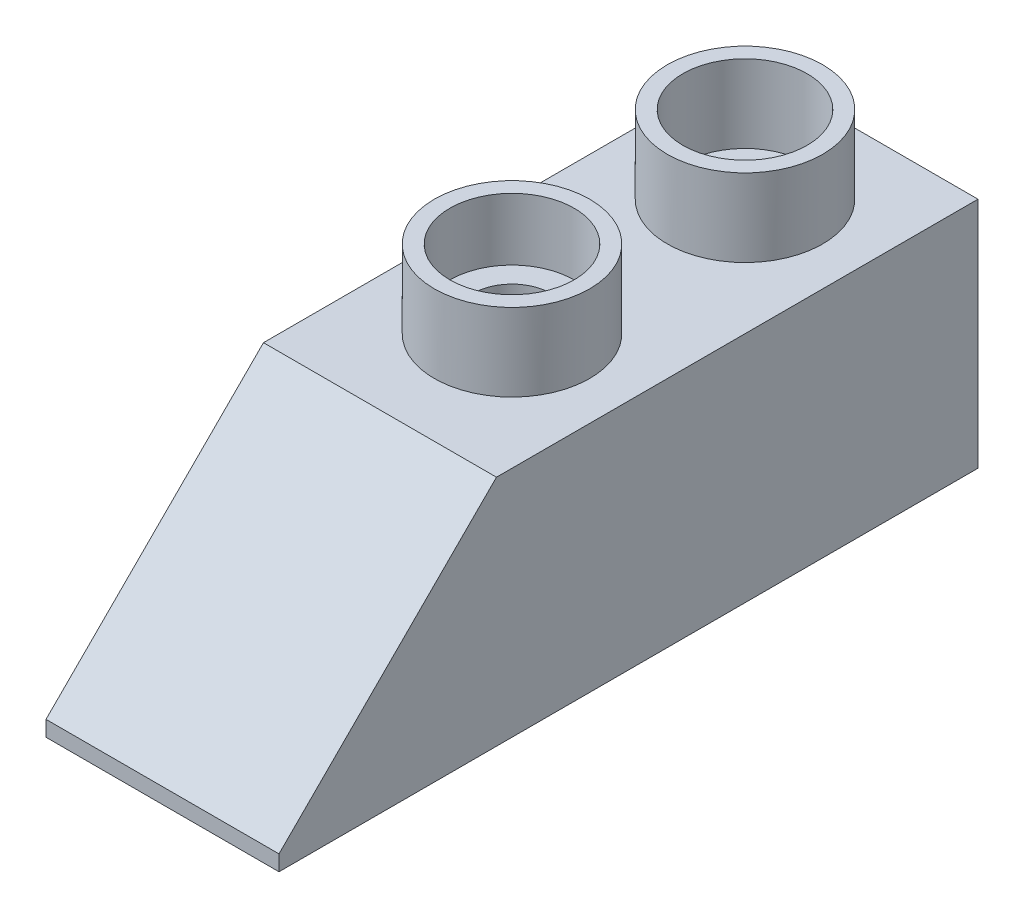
ISO-10303-21;
HEADER;
FILE_DESCRIPTION(('STEP AP214'),'2;1');
FILE_NAME('part.step','',(''),(''),'','','');
FILE_SCHEMA(('AUTOMOTIVE_DESIGN { 1 0 10303 214 1 1 1 1 }'));
ENDSEC;
DATA;
#1=APPLICATION_CONTEXT('core data for automotive mechanical design processes');
#2=APPLICATION_PROTOCOL_DEFINITION('international standard','automotive_design',2000,#1);
#3=PRODUCT_CONTEXT('',#1,'mechanical');
#4=PRODUCT('Part','Part','',(#3));
#5=PRODUCT_RELATED_PRODUCT_CATEGORY('part','',(#4));
#6=PRODUCT_DEFINITION_FORMATION('','',#4);
#7=PRODUCT_DEFINITION_CONTEXT('part definition',#1,'design');
#8=PRODUCT_DEFINITION('design','',#6,#7);
#9=PRODUCT_DEFINITION_SHAPE('','',#8);
#10=(LENGTH_UNIT() NAMED_UNIT(*) SI_UNIT(.MILLI.,.METRE.));
#11=(NAMED_UNIT(*) PLANE_ANGLE_UNIT() SI_UNIT($,.RADIAN.));
#12=(NAMED_UNIT(*) SI_UNIT($,.STERADIAN.) SOLID_ANGLE_UNIT());
#13=UNCERTAINTY_MEASURE_WITH_UNIT(LENGTH_MEASURE(1.E-05),#10,'distance_accuracy_value','');
#14=(GEOMETRIC_REPRESENTATION_CONTEXT(3) GLOBAL_UNCERTAINTY_ASSIGNED_CONTEXT((#13)) GLOBAL_UNIT_ASSIGNED_CONTEXT((#10,
#11,#12)) REPRESENTATION_CONTEXT('',''));
#15=CARTESIAN_POINT('',(0.,0.,0.));
#16=DIRECTION('',(0.,0.,1.));
#17=DIRECTION('',(1.,0.,0.));
#18=AXIS2_PLACEMENT_3D('',#15,#16,#17);
#19=CARTESIAN_POINT('',(0.,0.,0.));
#20=DIRECTION('',(0.,-1.,0.));
#21=DIRECTION('',(0.,0.,-1.));
#22=AXIS2_PLACEMENT_3D('',#19,#20,#21);
#23=PLANE('',#22);
#24=DIRECTION('',(0.,0.,-1.));
#25=VECTOR('',#24,1.);
#26=CARTESIAN_POINT('',(0.,0.,0.));
#27=LINE('',#26,#25);
#28=CARTESIAN_POINT('',(0.,0.,90.));
#29=VERTEX_POINT('',#28);
#30=CARTESIAN_POINT('',(0.,0.,0.));
#31=VERTEX_POINT('',#30);
#32=EDGE_CURVE('E217',#29,#31,#27,.T.);
#33=ORIENTED_EDGE('',*,*,#32,.F.);
#34=DIRECTION('',(1.,0.,0.));
#35=VECTOR('',#34,1.);
#36=CARTESIAN_POINT('',(0.,0.,90.));
#37=LINE('',#36,#35);
#38=CARTESIAN_POINT('',(-30.,0.,90.));
#39=VERTEX_POINT('',#38);
#40=EDGE_CURVE('E203',#39,#29,#37,.T.);
#41=ORIENTED_EDGE('',*,*,#40,.F.);
#42=DIRECTION('',(0.,0.,1.));
#43=VECTOR('',#42,1.);
#44=CARTESIAN_POINT('',(-30.,0.,0.));
#45=LINE('',#44,#43);
#46=CARTESIAN_POINT('',(-30.,0.,0.));
#47=VERTEX_POINT('',#46);
#48=EDGE_CURVE('E455',#47,#39,#45,.T.);
#49=ORIENTED_EDGE('',*,*,#48,.F.);
#50=DIRECTION('',(-1.,0.,0.));
#51=VECTOR('',#50,1.);
#52=CARTESIAN_POINT('',(0.,0.,0.));
#53=LINE('',#52,#51);
#54=EDGE_CURVE('E453',#31,#47,#53,.T.);
#55=ORIENTED_EDGE('',*,*,#54,.F.);
#56=EDGE_LOOP('',(#33,#41,#49,#55));
#57=FACE_BOUND('',#56,.T.);
#58=CARTESIAN_POINT('',(-26.5,0.,86.5));
#59=DIRECTION('',(0.,-1.,0.));
#60=DIRECTION('',(0.,0.,-1.));
#61=AXIS2_PLACEMENT_3D('',#58,#59,#60);
#62=CIRCLE('',#61,1.);
#63=CARTESIAN_POINT('',(-26.5,0.,87.5));
#64=VERTEX_POINT('',#63);
#65=CARTESIAN_POINT('',(-27.5,0.,86.5));
#66=VERTEX_POINT('',#65);
#67=EDGE_CURVE('E254',#64,#66,#62,.T.);
#68=ORIENTED_EDGE('',*,*,#67,.F.);
#69=DIRECTION('',(1.,0.,0.));
#70=VECTOR('',#69,1.);
#71=CARTESIAN_POINT('',(0.,0.,87.5));
#72=LINE('',#71,#70);
#73=CARTESIAN_POINT('',(-3.49999999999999,0.,87.5));
#74=VERTEX_POINT('',#73);
#75=EDGE_CURVE('E251',#64,#74,#72,.T.);
#76=ORIENTED_EDGE('',*,*,#75,.T.);
#77=CARTESIAN_POINT('',(-3.49999999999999,0.,86.5));
#78=DIRECTION('',(0.,-1.,0.));
#79=DIRECTION('',(0.,0.,-1.));
#80=AXIS2_PLACEMENT_3D('',#77,#78,#79);
#81=CIRCLE('',#80,1.);
#82=CARTESIAN_POINT('',(-2.49999999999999,0.,86.5));
#83=VERTEX_POINT('',#82);
#84=EDGE_CURVE('E248',#83,#74,#81,.T.);
#85=ORIENTED_EDGE('',*,*,#84,.F.);
#86=DIRECTION('',(0.,0.,-1.));
#87=VECTOR('',#86,1.);
#88=CARTESIAN_POINT('',(-2.5,0.,0.));
#89=LINE('',#88,#87);
#90=CARTESIAN_POINT('',(-2.5,0.,3.5));
#91=VERTEX_POINT('',#90);
#92=EDGE_CURVE('E246',#83,#91,#89,.T.);
#93=ORIENTED_EDGE('',*,*,#92,.T.);
#94=CARTESIAN_POINT('',(-3.5,0.,3.5));
#95=DIRECTION('',(0.,-1.,0.));
#96=DIRECTION('',(0.,0.,-1.));
#97=AXIS2_PLACEMENT_3D('',#94,#95,#96);
#98=CIRCLE('',#97,1.);
#99=CARTESIAN_POINT('',(-3.5,0.,2.5));
#100=VERTEX_POINT('',#99);
#101=EDGE_CURVE('E243',#100,#91,#98,.T.);
#102=ORIENTED_EDGE('',*,*,#101,.F.);
#103=DIRECTION('',(-1.,0.,0.));
#104=VECTOR('',#103,1.);
#105=CARTESIAN_POINT('',(0.,0.,2.5));
#106=LINE('',#105,#104);
#107=CARTESIAN_POINT('',(-26.5,0.,2.5));
#108=VERTEX_POINT('',#107);
#109=EDGE_CURVE('E239',#100,#108,#106,.T.);
#110=ORIENTED_EDGE('',*,*,#109,.T.);
#111=CARTESIAN_POINT('',(-26.5,0.,3.5));
#112=DIRECTION('',(0.,-1.,0.));
#113=DIRECTION('',(0.,0.,-1.));
#114=AXIS2_PLACEMENT_3D('',#111,#112,#113);
#115=CIRCLE('',#114,1.);
#116=CARTESIAN_POINT('',(-27.5,0.,3.5));
#117=VERTEX_POINT('',#116);
#118=EDGE_CURVE('E236',#117,#108,#115,.T.);
#119=ORIENTED_EDGE('',*,*,#118,.F.);
#120=DIRECTION('',(0.,0.,1.));
#121=VECTOR('',#120,1.);
#122=CARTESIAN_POINT('',(-27.5,0.,0.));
#123=LINE('',#122,#121);
#124=EDGE_CURVE('E241',#117,#66,#123,.T.);
#125=ORIENTED_EDGE('',*,*,#124,.T.);
#126=EDGE_LOOP('',(#68,#76,#85,#93,#102,#110,#119,#125));
#127=FACE_BOUND('',#126,.T.);
#128=ADVANCED_FACE('F44',(#57,#127),#23,.T.);
#129=CARTESIAN_POINT('',(-15.,0.,45.));
#130=DIRECTION('',(0.,-1.,0.));
#131=DIRECTION('',(0.,0.,-1.));
#132=AXIS2_PLACEMENT_3D('',#129,#130,#131);
#133=CIRCLE('',#132,7.5);
#134=CARTESIAN_POINT('',(-15.,0.,37.5));
#135=VERTEX_POINT('',#134);
#136=EDGE_CURVE('E294',#135,#135,#133,.T.);
#137=ORIENTED_EDGE('',*,*,#136,.T.);
#138=EDGE_LOOP('',(#137));
#139=FACE_BOUND('',#138,.T.);
#140=CARTESIAN_POINT('',(-15.,0.,45.));
#141=DIRECTION('',(0.,1.,0.));
#142=DIRECTION('',(0.,0.,1.));
#143=AXIS2_PLACEMENT_3D('',#140,#141,#142);
#144=CIRCLE('',#143,4.99999999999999);
#145=CARTESIAN_POINT('',(-15.,0.,50.));
#146=VERTEX_POINT('',#145);
#147=EDGE_CURVE('E429',#146,#146,#144,.T.);
#148=ORIENTED_EDGE('',*,*,#147,.T.);
#149=EDGE_LOOP('',(#148));
#150=FACE_BOUND('',#149,.T.);
#151=ADVANCED_FACE('F473',(#139,#150),#23,.T.);
#152=CARTESIAN_POINT('',(0.,30.,0.));
#153=DIRECTION('',(-1.,0.,0.));
#154=DIRECTION('',(0.,0.,1.));
#155=AXIS2_PLACEMENT_3D('',#152,#153,#154);
#156=PLANE('',#155);
#157=DIRECTION('',(0.,0.,-1.));
#158=VECTOR('',#157,1.);
#159=CARTESIAN_POINT('',(0.,30.,0.));
#160=LINE('',#159,#158);
#161=CARTESIAN_POINT('',(0.,30.,62.));
#162=VERTEX_POINT('',#161);
#163=CARTESIAN_POINT('',(0.,30.,0.));
#164=VERTEX_POINT('',#163);
#165=EDGE_CURVE('E193',#162,#164,#160,.T.);
#166=ORIENTED_EDGE('',*,*,#165,.F.);
#167=DIRECTION('',(0.,0.707106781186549,-0.707106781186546));
#168=VECTOR('',#167,1.);
#169=CARTESIAN_POINT('',(0.,30.,62.));
#170=LINE('',#169,#168);
#171=CARTESIAN_POINT('',(0.,1.99999999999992,90.));
#172=VERTEX_POINT('',#171);
#173=EDGE_CURVE('E230',#162,#172,#170,.F.);
#174=ORIENTED_EDGE('',*,*,#173,.T.);
#175=DIRECTION('',(0.,-1.,0.));
#176=VECTOR('',#175,1.);
#177=CARTESIAN_POINT('',(0.,30.,90.));
#178=LINE('',#177,#176);
#179=EDGE_CURVE('E451',#172,#29,#178,.T.);
#180=ORIENTED_EDGE('',*,*,#179,.T.);
#181=ORIENTED_EDGE('',*,*,#32,.T.);
#182=DIRECTION('',(0.,-1.,0.));
#183=VECTOR('',#182,1.);
#184=CARTESIAN_POINT('',(0.,30.,0.));
#185=LINE('',#184,#183);
#186=EDGE_CURVE('E208',#164,#31,#185,.T.);
#187=ORIENTED_EDGE('',*,*,#186,.F.);
#188=EDGE_LOOP('',(#166,#174,#180,#181,#187));
#189=FACE_BOUND('',#188,.T.);
#190=ADVANCED_FACE('F215',(#189),#156,.F.);
#191=CARTESIAN_POINT('',(0.,30.,0.));
#192=DIRECTION('',(0.,0.,1.));
#193=DIRECTION('',(1.,0.,0.));
#194=AXIS2_PLACEMENT_3D('',#191,#192,#193);
#195=PLANE('',#194);
#196=ORIENTED_EDGE('',*,*,#54,.T.);
#197=DIRECTION('',(0.,-1.,0.));
#198=VECTOR('',#197,1.);
#199=CARTESIAN_POINT('',(-30.,30.,0.));
#200=LINE('',#199,#198);
#201=CARTESIAN_POINT('',(-30.,30.,0.));
#202=VERTEX_POINT('',#201);
#203=EDGE_CURVE('E211',#202,#47,#200,.T.);
#204=ORIENTED_EDGE('',*,*,#203,.F.);
#205=DIRECTION('',(-1.,0.,0.));
#206=VECTOR('',#205,1.);
#207=CARTESIAN_POINT('',(0.,30.,0.));
#208=LINE('',#207,#206);
#209=EDGE_CURVE('E197',#164,#202,#208,.T.);
#210=ORIENTED_EDGE('',*,*,#209,.F.);
#211=ORIENTED_EDGE('',*,*,#186,.T.);
#212=EDGE_LOOP('',(#196,#204,#210,#211));
#213=FACE_BOUND('',#212,.T.);
#214=ADVANCED_FACE('F207',(#213),#195,.F.);
#215=CARTESIAN_POINT('',(-30.,30.,0.));
#216=DIRECTION('',(1.,0.,0.));
#217=DIRECTION('',(0.,0.,-1.));
#218=AXIS2_PLACEMENT_3D('',#215,#216,#217);
#219=PLANE('',#218);
#220=DIRECTION('',(0.,-1.,0.));
#221=VECTOR('',#220,1.);
#222=CARTESIAN_POINT('',(-30.,30.,90.));
#223=LINE('',#222,#221);
#224=CARTESIAN_POINT('',(-30.,1.99999999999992,90.));
#225=VERTEX_POINT('',#224);
#226=EDGE_CURVE('E223',#225,#39,#223,.T.);
#227=ORIENTED_EDGE('',*,*,#226,.F.);
#228=DIRECTION('',(0.,-0.707106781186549,0.707106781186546));
#229=VECTOR('',#228,1.);
#230=CARTESIAN_POINT('',(-30.,30.,62.));
#231=LINE('',#230,#229);
#232=CARTESIAN_POINT('',(-30.,30.,62.));
#233=VERTEX_POINT('',#232);
#234=EDGE_CURVE('E234',#225,#233,#231,.F.);
#235=ORIENTED_EDGE('',*,*,#234,.T.);
#236=DIRECTION('',(0.,0.,1.));
#237=VECTOR('',#236,1.);
#238=CARTESIAN_POINT('',(-30.,30.,0.));
#239=LINE('',#238,#237);
#240=EDGE_CURVE('E213',#202,#233,#239,.T.);
#241=ORIENTED_EDGE('',*,*,#240,.F.);
#242=ORIENTED_EDGE('',*,*,#203,.T.);
#243=ORIENTED_EDGE('',*,*,#48,.T.);
#244=EDGE_LOOP('',(#227,#235,#241,#242,#243));
#245=FACE_BOUND('',#244,.T.);
#246=ADVANCED_FACE('F469',(#245),#219,.F.);
#247=CARTESIAN_POINT('',(0.,30.,90.));
#248=DIRECTION('',(0.,0.,-1.));
#249=DIRECTION('',(-1.,0.,0.));
#250=AXIS2_PLACEMENT_3D('',#247,#248,#249);
#251=PLANE('',#250);
#252=ORIENTED_EDGE('',*,*,#179,.F.);
#253=DIRECTION('',(-1.,0.,0.));
#254=VECTOR('',#253,1.);
#255=CARTESIAN_POINT('',(0.,1.99999999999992,90.));
#256=LINE('',#255,#254);
#257=EDGE_CURVE('E232',#172,#225,#256,.T.);
#258=ORIENTED_EDGE('',*,*,#257,.T.);
#259=ORIENTED_EDGE('',*,*,#226,.T.);
#260=ORIENTED_EDGE('',*,*,#40,.T.);
#261=EDGE_LOOP('',(#252,#258,#259,#260));
#262=FACE_BOUND('',#261,.T.);
#263=ADVANCED_FACE('F463',(#262),#251,.F.);
#264=CARTESIAN_POINT('',(0.,30.,0.));
#265=DIRECTION('',(0.,-1.,0.));
#266=DIRECTION('',(0.,0.,-1.));
#267=AXIS2_PLACEMENT_3D('',#264,#265,#266);
#268=PLANE('',#267);
#269=CARTESIAN_POINT('',(-15.,30.,45.));
#270=DIRECTION('',(0.,-1.,0.));
#271=DIRECTION('',(0.,0.,-1.));
#272=AXIS2_PLACEMENT_3D('',#269,#270,#271);
#273=CIRCLE('',#272,10.);
#274=CARTESIAN_POINT('',(-15.,30.,35.));
#275=VERTEX_POINT('',#274);
#276=EDGE_CURVE('E221',#275,#275,#273,.F.);
#277=ORIENTED_EDGE('',*,*,#276,.F.);
#278=EDGE_LOOP('',(#277));
#279=FACE_BOUND('',#278,.T.);
#280=CARTESIAN_POINT('',(-15.,30.,15.));
#281=DIRECTION('',(0.,-1.,0.));
#282=DIRECTION('',(0.,0.,-1.));
#283=AXIS2_PLACEMENT_3D('',#280,#281,#282);
#284=CIRCLE('',#283,10.);
#285=CARTESIAN_POINT('',(-15.,30.,5.));
#286=VERTEX_POINT('',#285);
#287=EDGE_CURVE('E218',#286,#286,#284,.F.);
#288=ORIENTED_EDGE('',*,*,#287,.F.);
#289=EDGE_LOOP('',(#288));
#290=FACE_BOUND('',#289,.T.);
#291=ORIENTED_EDGE('',*,*,#240,.T.);
#292=DIRECTION('',(1.,0.,0.));
#293=VECTOR('',#292,1.);
#294=CARTESIAN_POINT('',(0.,30.,62.));
#295=LINE('',#294,#293);
#296=EDGE_CURVE('E200',#233,#162,#295,.T.);
#297=ORIENTED_EDGE('',*,*,#296,.T.);
#298=ORIENTED_EDGE('',*,*,#165,.T.);
#299=ORIENTED_EDGE('',*,*,#209,.T.);
#300=EDGE_LOOP('',(#291,#297,#298,#299));
#301=FACE_BOUND('',#300,.T.);
#302=ADVANCED_FACE('F196',(#279,#290,#301),#268,.F.);
#303=CARTESIAN_POINT('',(-15.,0.,15.));
#304=DIRECTION('',(0.,-1.,0.));
#305=DIRECTION('',(0.,0.,-1.));
#306=AXIS2_PLACEMENT_3D('',#303,#304,#305);
#307=CIRCLE('',#306,7.5);
#308=CARTESIAN_POINT('',(-15.,0.,7.5));
#309=VERTEX_POINT('',#308);
#310=EDGE_CURVE('E303',#309,#309,#307,.T.);
#311=ORIENTED_EDGE('',*,*,#310,.T.);
#312=EDGE_LOOP('',(#311));
#313=FACE_BOUND('',#312,.T.);
#314=CARTESIAN_POINT('',(-15.,0.,15.));
#315=DIRECTION('',(0.,1.,0.));
#316=DIRECTION('',(0.,0.,1.));
#317=AXIS2_PLACEMENT_3D('',#314,#315,#316);
#318=CIRCLE('',#317,5.);
#319=CARTESIAN_POINT('',(-15.,0.,20.));
#320=VERTEX_POINT('',#319);
#321=EDGE_CURVE('E433',#320,#320,#318,.T.);
#322=ORIENTED_EDGE('',*,*,#321,.T.);
#323=EDGE_LOOP('',(#322));
#324=FACE_BOUND('',#323,.T.);
#325=ADVANCED_FACE('F475',(#313,#324),#23,.T.);
#326=CARTESIAN_POINT('',(-15.,40.,15.));
#327=DIRECTION('',(0.,-1.,0.));
#328=DIRECTION('',(0.,0.,-1.));
#329=AXIS2_PLACEMENT_3D('',#326,#327,#328);
#330=CYLINDRICAL_SURFACE('',#329,10.);
#331=CARTESIAN_POINT('',(-15.,40.,15.));
#332=DIRECTION('',(0.,1.,0.));
#333=DIRECTION('',(0.,0.,1.));
#334=AXIS2_PLACEMENT_3D('',#331,#332,#333);
#335=CIRCLE('',#334,10.);
#336=CARTESIAN_POINT('',(-15.,40.,25.));
#337=VERTEX_POINT('',#336);
#338=EDGE_CURVE('E447',#337,#337,#335,.T.);
#339=ORIENTED_EDGE('',*,*,#338,.F.);
#340=EDGE_LOOP('',(#339));
#341=FACE_BOUND('',#340,.T.);
#342=ORIENTED_EDGE('',*,*,#287,.T.);
#343=EDGE_LOOP('',(#342));
#344=FACE_BOUND('',#343,.T.);
#345=ADVANCED_FACE('F671',(#341,#344),#330,.T.);
#346=CARTESIAN_POINT('',(-15.,40.,15.));
#347=DIRECTION('',(0.,1.,0.));
#348=DIRECTION('',(0.,0.,1.));
#349=AXIS2_PLACEMENT_3D('',#346,#347,#348);
#350=PLANE('',#349);
#351=CARTESIAN_POINT('',(-15.,40.,15.));
#352=DIRECTION('',(0.,1.,0.));
#353=DIRECTION('',(0.,0.,1.));
#354=AXIS2_PLACEMENT_3D('',#351,#352,#353);
#355=CIRCLE('',#354,8.);
#356=CARTESIAN_POINT('',(-15.,40.,23.));
#357=VERTEX_POINT('',#356);
#358=EDGE_CURVE('E436',#357,#357,#355,.T.);
#359=ORIENTED_EDGE('',*,*,#358,.F.);
#360=EDGE_LOOP('',(#359));
#361=FACE_BOUND('',#360,.T.);
#362=ORIENTED_EDGE('',*,*,#338,.T.);
#363=EDGE_LOOP('',(#362));
#364=FACE_BOUND('',#363,.T.);
#365=ADVANCED_FACE('F667',(#361,#364),#350,.T.);
#366=CARTESIAN_POINT('',(-15.,40.,45.));
#367=DIRECTION('',(0.,-1.,0.));
#368=DIRECTION('',(0.,0.,-1.));
#369=AXIS2_PLACEMENT_3D('',#366,#367,#368);
#370=CYLINDRICAL_SURFACE('',#369,10.);
#371=CARTESIAN_POINT('',(-15.,40.,45.));
#372=DIRECTION('',(0.,1.,0.));
#373=DIRECTION('',(0.,0.,1.));
#374=AXIS2_PLACEMENT_3D('',#371,#372,#373);
#375=CIRCLE('',#374,10.);
#376=CARTESIAN_POINT('',(-15.,40.,55.));
#377=VERTEX_POINT('',#376);
#378=EDGE_CURVE('E442',#377,#377,#375,.T.);
#379=ORIENTED_EDGE('',*,*,#378,.F.);
#380=EDGE_LOOP('',(#379));
#381=FACE_BOUND('',#380,.T.);
#382=ORIENTED_EDGE('',*,*,#276,.T.);
#383=EDGE_LOOP('',(#382));
#384=FACE_BOUND('',#383,.T.);
#385=ADVANCED_FACE('F663',(#381,#384),#370,.T.);
#386=CARTESIAN_POINT('',(-15.,40.,45.));
#387=DIRECTION('',(0.,1.,0.));
#388=DIRECTION('',(0.,0.,1.));
#389=AXIS2_PLACEMENT_3D('',#386,#387,#388);
#390=PLANE('',#389);
#391=CARTESIAN_POINT('',(-15.,40.,45.));
#392=DIRECTION('',(0.,1.,0.));
#393=DIRECTION('',(0.,0.,1.));
#394=AXIS2_PLACEMENT_3D('',#391,#392,#393);
#395=CIRCLE('',#394,8.);
#396=CARTESIAN_POINT('',(-15.,40.,53.));
#397=VERTEX_POINT('',#396);
#398=EDGE_CURVE('E416',#397,#397,#395,.T.);
#399=ORIENTED_EDGE('',*,*,#398,.F.);
#400=EDGE_LOOP('',(#399));
#401=FACE_BOUND('',#400,.T.);
#402=ORIENTED_EDGE('',*,*,#378,.T.);
#403=EDGE_LOOP('',(#402));
#404=FACE_BOUND('',#403,.T.);
#405=ADVANCED_FACE('F659',(#401,#404),#390,.T.);
#406=CARTESIAN_POINT('',(-15.,30.,15.));
#407=DIRECTION('',(0.,1.,0.));
#408=DIRECTION('',(0.,0.,1.));
#409=AXIS2_PLACEMENT_3D('',#406,#407,#408);
#410=CYLINDRICAL_SURFACE('',#409,8.);
#411=CARTESIAN_POINT('',(-15.,30.,15.));
#412=DIRECTION('',(0.,1.,0.));
#413=DIRECTION('',(0.,0.,1.));
#414=AXIS2_PLACEMENT_3D('',#411,#412,#413);
#415=CIRCLE('',#414,8.);
#416=CARTESIAN_POINT('',(-15.,30.,23.));
#417=VERTEX_POINT('',#416);
#418=EDGE_CURVE('E439',#417,#417,#415,.T.);
#419=ORIENTED_EDGE('',*,*,#418,.F.);
#420=EDGE_LOOP('',(#419));
#421=FACE_BOUND('',#420,.T.);
#422=ORIENTED_EDGE('',*,*,#358,.T.);
#423=EDGE_LOOP('',(#422));
#424=FACE_BOUND('',#423,.T.);
#425=ADVANCED_FACE('F655',(#421,#424),#410,.F.);
#426=CARTESIAN_POINT('',(-15.,30.,15.));
#427=DIRECTION('',(0.,1.,0.));
#428=DIRECTION('',(0.,0.,1.));
#429=AXIS2_PLACEMENT_3D('',#426,#427,#428);
#430=PLANE('',#429);
#431=CARTESIAN_POINT('',(-15.,30.,15.));
#432=DIRECTION('',(0.,1.,0.));
#433=DIRECTION('',(0.,0.,1.));
#434=AXIS2_PLACEMENT_3D('',#431,#432,#433);
#435=CIRCLE('',#434,5.);
#436=CARTESIAN_POINT('',(-15.,30.,20.));
#437=VERTEX_POINT('',#436);
#438=EDGE_CURVE('E432',#437,#437,#435,.T.);
#439=ORIENTED_EDGE('',*,*,#438,.F.);
#440=EDGE_LOOP('',(#439));
#441=FACE_BOUND('',#440,.T.);
#442=ORIENTED_EDGE('',*,*,#418,.T.);
#443=EDGE_LOOP('',(#442));
#444=FACE_BOUND('',#443,.T.);
#445=ADVANCED_FACE('F651',(#441,#444),#430,.T.);
#446=CARTESIAN_POINT('',(-15.,0.,15.));
#447=DIRECTION('',(0.,1.,0.));
#448=DIRECTION('',(0.,0.,1.));
#449=AXIS2_PLACEMENT_3D('',#446,#447,#448);
#450=CYLINDRICAL_SURFACE('',#449,5.);
#451=ORIENTED_EDGE('',*,*,#321,.F.);
#452=EDGE_LOOP('',(#451));
#453=FACE_BOUND('',#452,.T.);
#454=ORIENTED_EDGE('',*,*,#438,.T.);
#455=EDGE_LOOP('',(#454));
#456=FACE_BOUND('',#455,.T.);
#457=ADVANCED_FACE('F647',(#453,#456),#450,.F.);
#458=CARTESIAN_POINT('',(-15.,40.,45.));
#459=DIRECTION('',(0.,1.,0.));
#460=DIRECTION('',(0.,0.,1.));
#461=AXIS2_PLACEMENT_3D('',#458,#459,#460);
#462=CYLINDRICAL_SURFACE('',#461,5.);
#463=ORIENTED_EDGE('',*,*,#147,.F.);
#464=EDGE_LOOP('',(#463));
#465=FACE_BOUND('',#464,.T.);
#466=CARTESIAN_POINT('',(-15.,32.,45.));
#467=DIRECTION('',(0.,1.,0.));
#468=DIRECTION('',(0.,0.,1.));
#469=AXIS2_PLACEMENT_3D('',#466,#467,#468);
#470=CIRCLE('',#469,5.);
#471=CARTESIAN_POINT('',(-15.,32.,50.));
#472=VERTEX_POINT('',#471);
#473=EDGE_CURVE('E424',#472,#472,#470,.T.);
#474=ORIENTED_EDGE('',*,*,#473,.T.);
#475=EDGE_LOOP('',(#474));
#476=FACE_BOUND('',#475,.T.);
#477=ADVANCED_FACE('F643',(#465,#476),#462,.F.);
#478=CARTESIAN_POINT('',(-10.,32.,45.));
#479=DIRECTION('',(0.,-1.,0.));
#480=DIRECTION('',(0.,0.,-1.));
#481=AXIS2_PLACEMENT_3D('',#478,#479,#480);
#482=PLANE('',#481);
#483=ORIENTED_EDGE('',*,*,#473,.F.);
#484=EDGE_LOOP('',(#483));
#485=FACE_BOUND('',#484,.T.);
#486=CARTESIAN_POINT('',(-15.,32.,45.));
#487=DIRECTION('',(0.,1.,0.));
#488=DIRECTION('',(0.,0.,1.));
#489=AXIS2_PLACEMENT_3D('',#486,#487,#488);
#490=CIRCLE('',#489,8.);
#491=CARTESIAN_POINT('',(-15.,32.,53.));
#492=VERTEX_POINT('',#491);
#493=EDGE_CURVE('E419',#492,#492,#490,.T.);
#494=ORIENTED_EDGE('',*,*,#493,.T.);
#495=EDGE_LOOP('',(#494));
#496=FACE_BOUND('',#495,.T.);
#497=ADVANCED_FACE('F639',(#485,#496),#482,.F.);
#498=CARTESIAN_POINT('',(-15.,40.,45.));
#499=DIRECTION('',(0.,1.,0.));
#500=DIRECTION('',(0.,0.,1.));
#501=AXIS2_PLACEMENT_3D('',#498,#499,#500);
#502=CYLINDRICAL_SURFACE('',#501,8.);
#503=ORIENTED_EDGE('',*,*,#493,.F.);
#504=EDGE_LOOP('',(#503));
#505=FACE_BOUND('',#504,.T.);
#506=ORIENTED_EDGE('',*,*,#398,.T.);
#507=EDGE_LOOP('',(#506));
#508=FACE_BOUND('',#507,.T.);
#509=ADVANCED_FACE('F635',(#505,#508),#502,.F.);
#510=CARTESIAN_POINT('',(0.,30.,62.));
#511=DIRECTION('',(0.,-0.707106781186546,-0.707106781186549));
#512=DIRECTION('',(1.,0.,0.));
#513=AXIS2_PLACEMENT_3D('',#510,#511,#512);
#514=PLANE('',#513);
#515=ORIENTED_EDGE('',*,*,#234,.F.);
#516=ORIENTED_EDGE('',*,*,#257,.F.);
#517=ORIENTED_EDGE('',*,*,#173,.F.);
#518=ORIENTED_EDGE('',*,*,#296,.F.);
#519=EDGE_LOOP('',(#515,#516,#517,#518));
#520=FACE_BOUND('',#519,.T.);
#521=ADVANCED_FACE('F638',(#520),#514,.F.);
#522=CARTESIAN_POINT('',(0.,27.,0.));
#523=DIRECTION('',(0.,-1.,0.));
#524=DIRECTION('',(0.,0.,-1.));
#525=AXIS2_PLACEMENT_3D('',#522,#523,#524);
#526=PLANE('',#525);
#527=CARTESIAN_POINT('',(-15.,27.,45.));
#528=DIRECTION('',(0.,-1.,0.));
#529=DIRECTION('',(0.,0.,-1.));
#530=AXIS2_PLACEMENT_3D('',#527,#528,#529);
#531=CIRCLE('',#530,8.5);
#532=CARTESIAN_POINT('',(-15.,27.,36.5));
#533=VERTEX_POINT('',#532);
#534=EDGE_CURVE('E327',#533,#533,#531,.F.);
#535=ORIENTED_EDGE('',*,*,#534,.T.);
#536=EDGE_LOOP('',(#535));
#537=FACE_BOUND('',#536,.T.);
#538=CARTESIAN_POINT('',(-15.,27.,15.));
#539=DIRECTION('',(0.,-1.,0.));
#540=DIRECTION('',(0.,0.,-1.));
#541=AXIS2_PLACEMENT_3D('',#538,#539,#540);
#542=CIRCLE('',#541,8.5);
#543=CARTESIAN_POINT('',(-15.,27.,6.5));
#544=VERTEX_POINT('',#543);
#545=EDGE_CURVE('E324',#544,#544,#542,.F.);
#546=ORIENTED_EDGE('',*,*,#545,.T.);
#547=EDGE_LOOP('',(#546));
#548=FACE_BOUND('',#547,.T.);
#549=DIRECTION('',(-1.,0.,0.));
#550=VECTOR('',#549,1.);
#551=CARTESIAN_POINT('',(-3.,27.,3.5));
#552=LINE('',#551,#550);
#553=CARTESIAN_POINT('',(-26.5,27.,3.5));
#554=VERTEX_POINT('',#553);
#555=CARTESIAN_POINT('',(-3.5,27.,3.5));
#556=VERTEX_POINT('',#555);
#557=EDGE_CURVE('E319',#554,#556,#552,.F.);
#558=ORIENTED_EDGE('',*,*,#557,.T.);
#559=DIRECTION('',(0.,0.,-1.));
#560=VECTOR('',#559,1.);
#561=CARTESIAN_POINT('',(-3.49999999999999,27.,60.7573593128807));
#562=LINE('',#561,#560);
#563=CARTESIAN_POINT('',(-3.49999999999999,27.,60.5502525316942));
#564=VERTEX_POINT('',#563);
#565=EDGE_CURVE('E321',#556,#564,#562,.F.);
#566=ORIENTED_EDGE('',*,*,#565,.T.);
#567=DIRECTION('',(-1.,0.,0.));
#568=VECTOR('',#567,1.);
#569=CARTESIAN_POINT('',(0.,27.,60.5502525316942));
#570=LINE('',#569,#568);
#571=CARTESIAN_POINT('',(-26.5,27.,60.5502525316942));
#572=VERTEX_POINT('',#571);
#573=EDGE_CURVE('E315',#564,#572,#570,.T.);
#574=ORIENTED_EDGE('',*,*,#573,.T.);
#575=DIRECTION('',(0.,0.,1.));
#576=VECTOR('',#575,1.);
#577=CARTESIAN_POINT('',(-26.5,27.,3.));
#578=LINE('',#577,#576);
#579=EDGE_CURVE('E317',#572,#554,#578,.F.);
#580=ORIENTED_EDGE('',*,*,#579,.T.);
#581=EDGE_LOOP('',(#558,#566,#574,#580));
#582=FACE_BOUND('',#581,.T.);
#583=ADVANCED_FACE('F555',(#537,#548,#582),#526,.T.);
#584=CARTESIAN_POINT('',(-3.,30.,0.));
#585=DIRECTION('',(-1.,0.,0.));
#586=DIRECTION('',(0.,0.,1.));
#587=AXIS2_PLACEMENT_3D('',#584,#585,#586);
#588=PLANE('',#587);
#589=DIRECTION('',(0.,0.,-1.));
#590=VECTOR('',#589,1.);
#591=CARTESIAN_POINT('',(-3.,0.5,0.));
#592=LINE('',#591,#590);
#593=CARTESIAN_POINT('',(-3.,0.5,3.5));
#594=VERTEX_POINT('',#593);
#595=CARTESIAN_POINT('',(-2.99999999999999,0.5,86.5));
#596=VERTEX_POINT('',#595);
#597=EDGE_CURVE('E272',#594,#596,#592,.F.);
#598=ORIENTED_EDGE('',*,*,#597,.T.);
#599=DIRECTION('',(0.,-1.,0.));
#600=VECTOR('',#599,1.);
#601=CARTESIAN_POINT('',(-2.99999999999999,0.757359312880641,86.5));
#602=LINE('',#601,#600);
#603=CARTESIAN_POINT('',(-2.99999999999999,0.550252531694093,86.5));
#604=VERTEX_POINT('',#603);
#605=EDGE_CURVE('E274',#596,#604,#602,.F.);
#606=ORIENTED_EDGE('',*,*,#605,.T.);
#607=DIRECTION('',(0.,0.707106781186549,-0.707106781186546));
#608=VECTOR('',#607,1.);
#609=CARTESIAN_POINT('',(-3.,58.5251262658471,28.5251262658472));
#610=LINE('',#609,#608);
#611=CARTESIAN_POINT('',(-2.99999999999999,26.5,60.5502525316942));
#612=VERTEX_POINT('',#611);
#613=EDGE_CURVE('E266',#604,#612,#610,.T.);
#614=ORIENTED_EDGE('',*,*,#613,.T.);
#615=DIRECTION('',(0.,0.,-1.));
#616=VECTOR('',#615,1.);
#617=CARTESIAN_POINT('',(-3.,26.5,3.));
#618=LINE('',#617,#616);
#619=CARTESIAN_POINT('',(-3.,26.5,3.5));
#620=VERTEX_POINT('',#619);
#621=EDGE_CURVE('E268',#612,#620,#618,.T.);
#622=ORIENTED_EDGE('',*,*,#621,.T.);
#623=DIRECTION('',(0.,-1.,0.));
#624=VECTOR('',#623,1.);
#625=CARTESIAN_POINT('',(-3.,0.,3.5));
#626=LINE('',#625,#624);
#627=EDGE_CURVE('E270',#620,#594,#626,.T.);
#628=ORIENTED_EDGE('',*,*,#627,.T.);
#629=EDGE_LOOP('',(#598,#606,#614,#622,#628));
#630=FACE_BOUND('',#629,.T.);
#631=ADVANCED_FACE('F529',(#630),#588,.T.);
#632=CARTESIAN_POINT('',(0.,30.,3.));
#633=DIRECTION('',(0.,0.,1.));
#634=DIRECTION('',(1.,0.,0.));
#635=AXIS2_PLACEMENT_3D('',#632,#633,#634);
#636=PLANE('',#635);
#637=DIRECTION('',(0.,-1.,0.));
#638=VECTOR('',#637,1.);
#639=CARTESIAN_POINT('',(-26.5,0.,3.));
#640=LINE('',#639,#638);
#641=CARTESIAN_POINT('',(-26.5,26.5,3.));
#642=VERTEX_POINT('',#641);
#643=CARTESIAN_POINT('',(-26.5,0.5,3.));
#644=VERTEX_POINT('',#643);
#645=EDGE_CURVE('E310',#642,#644,#640,.T.);
#646=ORIENTED_EDGE('',*,*,#645,.T.);
#647=DIRECTION('',(-1.,0.,0.));
#648=VECTOR('',#647,1.);
#649=CARTESIAN_POINT('',(0.,0.5,3.));
#650=LINE('',#649,#648);
#651=CARTESIAN_POINT('',(-3.5,0.5,3.));
#652=VERTEX_POINT('',#651);
#653=EDGE_CURVE('E313',#644,#652,#650,.F.);
#654=ORIENTED_EDGE('',*,*,#653,.T.);
#655=DIRECTION('',(0.,-1.,0.));
#656=VECTOR('',#655,1.);
#657=CARTESIAN_POINT('',(-3.5,27.,3.));
#658=LINE('',#657,#656);
#659=CARTESIAN_POINT('',(-3.5,26.5,3.));
#660=VERTEX_POINT('',#659);
#661=EDGE_CURVE('E308',#652,#660,#658,.F.);
#662=ORIENTED_EDGE('',*,*,#661,.T.);
#663=DIRECTION('',(-1.,0.,0.));
#664=VECTOR('',#663,1.);
#665=CARTESIAN_POINT('',(-27.,26.5,3.));
#666=LINE('',#665,#664);
#667=EDGE_CURVE('E306',#660,#642,#666,.T.);
#668=ORIENTED_EDGE('',*,*,#667,.T.);
#669=EDGE_LOOP('',(#646,#654,#662,#668));
#670=FACE_BOUND('',#669,.T.);
#671=ADVANCED_FACE('F540',(#670),#636,.T.);
#672=CARTESIAN_POINT('',(-27.,30.,0.));
#673=DIRECTION('',(1.,0.,0.));
#674=DIRECTION('',(0.,0.,-1.));
#675=AXIS2_PLACEMENT_3D('',#672,#673,#674);
#676=PLANE('',#675);
#677=DIRECTION('',(0.,-1.,0.));
#678=VECTOR('',#677,1.);
#679=CARTESIAN_POINT('',(-27.,0.,86.5));
#680=LINE('',#679,#678);
#681=CARTESIAN_POINT('',(-27.,0.55025253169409,86.5));
#682=VERTEX_POINT('',#681);
#683=CARTESIAN_POINT('',(-27.,0.5,86.5));
#684=VERTEX_POINT('',#683);
#685=EDGE_CURVE('E283',#682,#684,#680,.T.);
#686=ORIENTED_EDGE('',*,*,#685,.T.);
#687=DIRECTION('',(0.,0.,1.));
#688=VECTOR('',#687,1.);
#689=CARTESIAN_POINT('',(-27.,0.5,0.));
#690=LINE('',#689,#688);
#691=CARTESIAN_POINT('',(-27.,0.5,3.5));
#692=VERTEX_POINT('',#691);
#693=EDGE_CURVE('E285',#684,#692,#690,.F.);
#694=ORIENTED_EDGE('',*,*,#693,.T.);
#695=DIRECTION('',(0.,-1.,0.));
#696=VECTOR('',#695,1.);
#697=CARTESIAN_POINT('',(-27.,27.,3.5));
#698=LINE('',#697,#696);
#699=CARTESIAN_POINT('',(-27.,26.5,3.5));
#700=VERTEX_POINT('',#699);
#701=EDGE_CURVE('E281',#692,#700,#698,.F.);
#702=ORIENTED_EDGE('',*,*,#701,.T.);
#703=DIRECTION('',(0.,0.,1.));
#704=VECTOR('',#703,1.);
#705=CARTESIAN_POINT('',(-27.,26.5,60.7573593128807));
#706=LINE('',#705,#704);
#707=CARTESIAN_POINT('',(-27.,26.5,60.5502525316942));
#708=VERTEX_POINT('',#707);
#709=EDGE_CURVE('E279',#700,#708,#706,.T.);
#710=ORIENTED_EDGE('',*,*,#709,.T.);
#711=DIRECTION('',(0.,-0.707106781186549,0.707106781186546));
#712=VECTOR('',#711,1.);
#713=CARTESIAN_POINT('',(-27.,58.5251262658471,28.5251262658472));
#714=LINE('',#713,#712);
#715=EDGE_CURVE('E277',#708,#682,#714,.T.);
#716=ORIENTED_EDGE('',*,*,#715,.T.);
#717=EDGE_LOOP('',(#686,#694,#702,#710,#716));
#718=FACE_BOUND('',#717,.T.);
#719=ADVANCED_FACE('F566',(#718),#676,.T.);
#720=CARTESIAN_POINT('',(0.,30.,87.));
#721=DIRECTION('',(0.,0.,-1.));
#722=DIRECTION('',(-1.,0.,0.));
#723=AXIS2_PLACEMENT_3D('',#720,#721,#722);
#724=PLANE('',#723);
#725=DIRECTION('',(0.,-1.,0.));
#726=VECTOR('',#725,1.);
#727=CARTESIAN_POINT('',(-3.49999999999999,0.,87.));
#728=LINE('',#727,#726);
#729=CARTESIAN_POINT('',(-3.49999999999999,0.550252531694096,87.));
#730=VERTEX_POINT('',#729);
#731=CARTESIAN_POINT('',(-3.49999999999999,0.5,87.));
#732=VERTEX_POINT('',#731);
#733=EDGE_CURVE('E261',#730,#732,#728,.T.);
#734=ORIENTED_EDGE('',*,*,#733,.T.);
#735=DIRECTION('',(1.,0.,0.));
#736=VECTOR('',#735,1.);
#737=CARTESIAN_POINT('',(0.,0.5,87.));
#738=LINE('',#737,#736);
#739=CARTESIAN_POINT('',(-26.5,0.5,87.));
#740=VERTEX_POINT('',#739);
#741=EDGE_CURVE('E263',#732,#740,#738,.F.);
#742=ORIENTED_EDGE('',*,*,#741,.T.);
#743=DIRECTION('',(0.,-1.,0.));
#744=VECTOR('',#743,1.);
#745=CARTESIAN_POINT('',(-26.5,0.757359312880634,87.));
#746=LINE('',#745,#744);
#747=CARTESIAN_POINT('',(-26.5,0.550252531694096,87.));
#748=VERTEX_POINT('',#747);
#749=EDGE_CURVE('E259',#740,#748,#746,.F.);
#750=ORIENTED_EDGE('',*,*,#749,.T.);
#751=DIRECTION('',(1.,0.,0.));
#752=VECTOR('',#751,1.);
#753=CARTESIAN_POINT('',(0.,0.550252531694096,87.));
#754=LINE('',#753,#752);
#755=EDGE_CURVE('E257',#748,#730,#754,.T.);
#756=ORIENTED_EDGE('',*,*,#755,.T.);
#757=EDGE_LOOP('',(#734,#742,#750,#756));
#758=FACE_BOUND('',#757,.T.);
#759=ADVANCED_FACE('F520',(#758),#724,.T.);
#760=CARTESIAN_POINT('',(-15.,0.,15.));
#761=DIRECTION('',(0.,1.,0.));
#762=DIRECTION('',(0.,0.,1.));
#763=AXIS2_PLACEMENT_3D('',#760,#761,#762);
#764=CYLINDRICAL_SURFACE('',#763,8.);
#765=CARTESIAN_POINT('',(-15.,0.5,15.));
#766=DIRECTION('',(0.,-1.,0.));
#767=DIRECTION('',(0.,0.,-1.));
#768=AXIS2_PLACEMENT_3D('',#765,#766,#767);
#769=CIRCLE('',#768,8.);
#770=CARTESIAN_POINT('',(-15.,0.5,7.));
#771=VERTEX_POINT('',#770);
#772=EDGE_CURVE('E300',#771,#771,#769,.F.);
#773=ORIENTED_EDGE('',*,*,#772,.T.);
#774=EDGE_LOOP('',(#773));
#775=FACE_BOUND('',#774,.T.);
#776=CARTESIAN_POINT('',(-15.,26.5,15.));
#777=DIRECTION('',(0.,-1.,0.));
#778=DIRECTION('',(0.,0.,-1.));
#779=AXIS2_PLACEMENT_3D('',#776,#777,#778);
#780=CIRCLE('',#779,8.);
#781=CARTESIAN_POINT('',(-15.,26.5,7.));
#782=VERTEX_POINT('',#781);
#783=EDGE_CURVE('E297',#782,#782,#780,.T.);
#784=ORIENTED_EDGE('',*,*,#783,.T.);
#785=EDGE_LOOP('',(#784));
#786=FACE_BOUND('',#785,.T.);
#787=ADVANCED_FACE('F623',(#775,#786),#764,.T.);
#788=CARTESIAN_POINT('',(-15.,40.,45.));
#789=DIRECTION('',(0.,1.,0.));
#790=DIRECTION('',(0.,0.,1.));
#791=AXIS2_PLACEMENT_3D('',#788,#789,#790);
#792=CYLINDRICAL_SURFACE('',#791,8.);
#793=CARTESIAN_POINT('',(-15.,0.5,45.));
#794=DIRECTION('',(0.,-1.,0.));
#795=DIRECTION('',(0.,0.,-1.));
#796=AXIS2_PLACEMENT_3D('',#793,#794,#795);
#797=CIRCLE('',#796,8.);
#798=CARTESIAN_POINT('',(-15.,0.5,37.));
#799=VERTEX_POINT('',#798);
#800=EDGE_CURVE('E291',#799,#799,#797,.F.);
#801=ORIENTED_EDGE('',*,*,#800,.T.);
#802=EDGE_LOOP('',(#801));
#803=FACE_BOUND('',#802,.T.);
#804=CARTESIAN_POINT('',(-15.,26.5,45.));
#805=DIRECTION('',(0.,-1.,0.));
#806=DIRECTION('',(0.,0.,-1.));
#807=AXIS2_PLACEMENT_3D('',#804,#805,#806);
#808=CIRCLE('',#807,8.);
#809=CARTESIAN_POINT('',(-15.,26.5,37.));
#810=VERTEX_POINT('',#809);
#811=EDGE_CURVE('E288',#810,#810,#808,.T.);
#812=ORIENTED_EDGE('',*,*,#811,.T.);
#813=EDGE_LOOP('',(#812));
#814=FACE_BOUND('',#813,.T.);
#815=ADVANCED_FACE('F621',(#803,#814),#792,.T.);
#816=CARTESIAN_POINT('',(0.,27.8786796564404,59.8786796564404));
#817=DIRECTION('',(0.,-0.707106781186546,-0.707106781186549));
#818=DIRECTION('',(1.,0.,0.));
#819=AXIS2_PLACEMENT_3D('',#816,#817,#818);
#820=PLANE('',#819);
#821=DIRECTION('',(0.,-0.707106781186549,0.707106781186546));
#822=VECTOR('',#821,1.);
#823=CARTESIAN_POINT('',(-3.49999999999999,27.8786796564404,59.8786796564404));
#824=LINE('',#823,#822);
#825=CARTESIAN_POINT('',(-3.49999999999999,26.8535533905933,60.9038059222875));
#826=VERTEX_POINT('',#825);
#827=CARTESIAN_POINT('',(-3.49999999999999,0.903805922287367,86.8535533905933));
#828=VERTEX_POINT('',#827);
#829=EDGE_CURVE('E53',#826,#828,#824,.T.);
#830=ORIENTED_EDGE('',*,*,#829,.T.);
#831=DIRECTION('',(-1.,0.,0.));
#832=VECTOR('',#831,1.);
#833=CARTESIAN_POINT('',(0.,0.903805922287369,86.8535533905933));
#834=LINE('',#833,#832);
#835=CARTESIAN_POINT('',(-26.5,0.903805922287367,86.8535533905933));
#836=VERTEX_POINT('',#835);
#837=EDGE_CURVE('E13',#828,#836,#834,.T.);
#838=ORIENTED_EDGE('',*,*,#837,.T.);
#839=DIRECTION('',(0.,0.707106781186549,-0.707106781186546));
#840=VECTOR('',#839,1.);
#841=CARTESIAN_POINT('',(-26.5,27.8786796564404,59.8786796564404));
#842=LINE('',#841,#840);
#843=CARTESIAN_POINT('',(-26.5,26.8535533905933,60.9038059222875));
#844=VERTEX_POINT('',#843);
#845=EDGE_CURVE('E330',#836,#844,#842,.T.);
#846=ORIENTED_EDGE('',*,*,#845,.T.);
#847=DIRECTION('',(1.,0.,0.));
#848=VECTOR('',#847,1.);
#849=CARTESIAN_POINT('',(0.,26.8535533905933,60.9038059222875));
#850=LINE('',#849,#848);
#851=EDGE_CURVE('E64',#844,#826,#850,.T.);
#852=ORIENTED_EDGE('',*,*,#851,.T.);
#853=EDGE_LOOP('',(#830,#838,#846,#852));
#854=FACE_BOUND('',#853,.T.);
#855=ADVANCED_FACE('F602',(#854),#820,.T.);
#856=CARTESIAN_POINT('',(-26.5,26.5,0.));
#857=DIRECTION('',(0.,0.,-1.));
#858=DIRECTION('',(-1.,0.,0.));
#859=AXIS2_PLACEMENT_3D('',#856,#857,#858);
#860=CYLINDRICAL_SURFACE('',#859,0.5);
#861=CARTESIAN_POINT('',(-26.5,26.5,3.5));
#862=DIRECTION('',(0.,0.,1.));
#863=DIRECTION('',(1.,0.,0.));
#864=AXIS2_PLACEMENT_3D('',#861,#862,#863);
#865=CIRCLE('',#864,0.5);
#866=EDGE_CURVE('E408',#554,#700,#865,.T.);
#867=ORIENTED_EDGE('',*,*,#866,.F.);
#868=ORIENTED_EDGE('',*,*,#579,.F.);
#869=CARTESIAN_POINT('',(-26.5,26.5,60.5502525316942));
#870=DIRECTION('',(0.,0.,-1.));
#871=DIRECTION('',(-1.,0.,0.));
#872=AXIS2_PLACEMENT_3D('',#869,#870,#871);
#873=CIRCLE('',#872,0.5);
#874=EDGE_CURVE('E410',#708,#572,#873,.T.);
#875=ORIENTED_EDGE('',*,*,#874,.F.);
#876=ORIENTED_EDGE('',*,*,#709,.F.);
#877=EDGE_LOOP('',(#867,#868,#875,#876));
#878=FACE_BOUND('',#877,.T.);
#879=ADVANCED_FACE('F560',(#878),#860,.F.);
#880=CARTESIAN_POINT('',(0.,26.5,3.5));
#881=DIRECTION('',(1.,0.,0.));
#882=DIRECTION('',(0.,0.,-1.));
#883=AXIS2_PLACEMENT_3D('',#880,#881,#882);
#884=CYLINDRICAL_SURFACE('',#883,0.5);
#885=CARTESIAN_POINT('',(-3.5,26.5,3.5));
#886=DIRECTION('',(-1.,0.,0.));
#887=DIRECTION('',(0.,0.,1.));
#888=AXIS2_PLACEMENT_3D('',#885,#886,#887);
#889=CIRCLE('',#888,0.5);
#890=EDGE_CURVE('E402',#556,#660,#889,.T.);
#891=ORIENTED_EDGE('',*,*,#890,.F.);
#892=ORIENTED_EDGE('',*,*,#557,.F.);
#893=CARTESIAN_POINT('',(-26.5,26.5,3.5));
#894=DIRECTION('',(1.,0.,0.));
#895=DIRECTION('',(0.,0.,-1.));
#896=AXIS2_PLACEMENT_3D('',#893,#894,#895);
#897=CIRCLE('',#896,0.5);
#898=EDGE_CURVE('E405',#642,#554,#897,.T.);
#899=ORIENTED_EDGE('',*,*,#898,.F.);
#900=ORIENTED_EDGE('',*,*,#667,.F.);
#901=EDGE_LOOP('',(#891,#892,#899,#900));
#902=FACE_BOUND('',#901,.T.);
#903=ADVANCED_FACE('F544',(#902),#884,.F.);
#904=CARTESIAN_POINT('',(-3.5,26.5,0.));
#905=DIRECTION('',(0.,0.,1.));
#906=DIRECTION('',(1.,0.,0.));
#907=AXIS2_PLACEMENT_3D('',#904,#905,#906);
#908=CYLINDRICAL_SURFACE('',#907,0.5);
#909=CARTESIAN_POINT('',(-3.49999999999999,26.5,60.5502525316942));
#910=DIRECTION('',(0.,0.,-1.));
#911=DIRECTION('',(-1.,0.,0.));
#912=AXIS2_PLACEMENT_3D('',#909,#910,#911);
#913=CIRCLE('',#912,0.5);
#914=EDGE_CURVE('E396',#564,#612,#913,.T.);
#915=ORIENTED_EDGE('',*,*,#914,.F.);
#916=ORIENTED_EDGE('',*,*,#565,.F.);
#917=CARTESIAN_POINT('',(-3.5,26.5,3.5));
#918=DIRECTION('',(0.,0.,1.));
#919=DIRECTION('',(1.,0.,0.));
#920=AXIS2_PLACEMENT_3D('',#917,#918,#919);
#921=CIRCLE('',#920,0.5);
#922=EDGE_CURVE('E399',#620,#556,#921,.T.);
#923=ORIENTED_EDGE('',*,*,#922,.F.);
#924=ORIENTED_EDGE('',*,*,#621,.F.);
#925=EDGE_LOOP('',(#915,#916,#923,#924));
#926=FACE_BOUND('',#925,.T.);
#927=ADVANCED_FACE('F552',(#926),#908,.F.);
#928=CARTESIAN_POINT('',(0.,26.5,60.5502525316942));
#929=DIRECTION('',(-1.,0.,0.));
#930=DIRECTION('',(0.,0.,1.));
#931=AXIS2_PLACEMENT_3D('',#928,#929,#930);
#932=CYLINDRICAL_SURFACE('',#931,0.5);
#933=CARTESIAN_POINT('',(-26.5,26.5,60.5502525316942));
#934=DIRECTION('',(1.,0.,0.));
#935=DIRECTION('',(0.,0.,-1.));
#936=AXIS2_PLACEMENT_3D('',#933,#934,#935);
#937=CIRCLE('',#936,0.5);
#938=EDGE_CURVE('E48',#572,#844,#937,.T.);
#939=ORIENTED_EDGE('',*,*,#938,.F.);
#940=ORIENTED_EDGE('',*,*,#573,.F.);
#941=CARTESIAN_POINT('',(-3.49999999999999,26.5,60.5502525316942));
#942=DIRECTION('',(-1.,0.,0.));
#943=DIRECTION('',(0.,0.,1.));
#944=AXIS2_PLACEMENT_3D('',#941,#942,#943);
#945=CIRCLE('',#944,0.5);
#946=EDGE_CURVE('E394',#826,#564,#945,.T.);
#947=ORIENTED_EDGE('',*,*,#946,.F.);
#948=ORIENTED_EDGE('',*,*,#851,.F.);
#949=EDGE_LOOP('',(#939,#940,#947,#948));
#950=FACE_BOUND('',#949,.T.);
#951=ADVANCED_FACE('F587',(#950),#932,.F.);
#952=CARTESIAN_POINT('',(-26.5,26.5,60.5502525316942));
#953=DIRECTION('',(0.,0.,1.));
#954=DIRECTION('',(1.,0.,0.));
#955=AXIS2_PLACEMENT_3D('',#952,#953,#954);
#956=SPHERICAL_SURFACE('',#955,0.5);
#957=ORIENTED_EDGE('',*,*,#874,.T.);
#958=ORIENTED_EDGE('',*,*,#938,.T.);
#959=CARTESIAN_POINT('',(-26.5,26.5,60.5502525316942));
#960=DIRECTION('',(0.,-0.707106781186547,0.707106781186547));
#961=DIRECTION('',(0.,-0.707106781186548,-0.707106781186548));
#962=AXIS2_PLACEMENT_3D('',#959,#960,#961);
#963=CIRCLE('',#962,0.5);
#964=EDGE_CURVE('E391',#708,#844,#963,.F.);
#965=ORIENTED_EDGE('',*,*,#964,.F.);
#966=EDGE_LOOP('',(#957,#958,#965));
#967=FACE_BOUND('',#966,.T.);
#968=ADVANCED_FACE('F569',(#967),#956,.F.);
#969=CARTESIAN_POINT('',(-26.5,26.5,3.5));
#970=DIRECTION('',(0.,0.,1.));
#971=DIRECTION('',(1.,0.,0.));
#972=AXIS2_PLACEMENT_3D('',#969,#970,#971);
#973=SPHERICAL_SURFACE('',#972,0.5);
#974=ORIENTED_EDGE('',*,*,#898,.T.);
#975=ORIENTED_EDGE('',*,*,#866,.T.);
#976=CARTESIAN_POINT('',(-26.5,26.5,3.5));
#977=DIRECTION('',(0.,-1.,0.));
#978=DIRECTION('',(0.,0.,-1.));
#979=AXIS2_PLACEMENT_3D('',#976,#977,#978);
#980=CIRCLE('',#979,0.5);
#981=EDGE_CURVE('E388',#642,#700,#980,.F.);
#982=ORIENTED_EDGE('',*,*,#981,.F.);
#983=EDGE_LOOP('',(#974,#975,#982));
#984=FACE_BOUND('',#983,.T.);
#985=ADVANCED_FACE('F562',(#984),#973,.F.);
#986=CARTESIAN_POINT('',(-3.5,26.5,3.5));
#987=DIRECTION('',(0.,0.,1.));
#988=DIRECTION('',(1.,0.,0.));
#989=AXIS2_PLACEMENT_3D('',#986,#987,#988);
#990=SPHERICAL_SURFACE('',#989,0.5);
#991=ORIENTED_EDGE('',*,*,#922,.T.);
#992=ORIENTED_EDGE('',*,*,#890,.T.);
#993=CARTESIAN_POINT('',(-3.5,26.5,3.5));
#994=DIRECTION('',(0.,-1.,0.));
#995=DIRECTION('',(0.,0.,-1.));
#996=AXIS2_PLACEMENT_3D('',#993,#994,#995);
#997=CIRCLE('',#996,0.5);
#998=EDGE_CURVE('E385',#620,#660,#997,.F.);
#999=ORIENTED_EDGE('',*,*,#998,.F.);
#1000=EDGE_LOOP('',(#991,#992,#999));
#1001=FACE_BOUND('',#1000,.T.);
#1002=ADVANCED_FACE('F548',(#1001),#990,.F.);
#1003=CARTESIAN_POINT('',(-3.49999999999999,26.5,60.5502525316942));
#1004=DIRECTION('',(0.,0.,1.));
#1005=DIRECTION('',(1.,0.,0.));
#1006=AXIS2_PLACEMENT_3D('',#1003,#1004,#1005);
#1007=SPHERICAL_SURFACE('',#1006,0.5);
#1008=ORIENTED_EDGE('',*,*,#946,.T.);
#1009=ORIENTED_EDGE('',*,*,#914,.T.);
#1010=CARTESIAN_POINT('',(-3.49999999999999,26.5,60.5502525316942));
#1011=DIRECTION('',(0.,-0.707106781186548,0.707106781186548));
#1012=DIRECTION('',(0.,-0.707106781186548,-0.707106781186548));
#1013=AXIS2_PLACEMENT_3D('',#1010,#1011,#1012);
#1014=CIRCLE('',#1013,0.5);
#1015=EDGE_CURVE('E382',#826,#612,#1014,.F.);
#1016=ORIENTED_EDGE('',*,*,#1015,.F.);
#1017=EDGE_LOOP('',(#1008,#1009,#1016));
#1018=FACE_BOUND('',#1017,.T.);
#1019=ADVANCED_FACE('F585',(#1018),#1007,.F.);
#1020=CARTESIAN_POINT('',(-26.5,27.5251262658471,59.5251262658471));
#1021=DIRECTION('',(0.,-0.707106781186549,0.707106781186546));
#1022=DIRECTION('',(0.,-0.707106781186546,-0.707106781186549));
#1023=AXIS2_PLACEMENT_3D('',#1020,#1021,#1022);
#1024=CYLINDRICAL_SURFACE('',#1023,0.5);
#1025=ORIENTED_EDGE('',*,*,#964,.T.);
#1026=ORIENTED_EDGE('',*,*,#845,.F.);
#1027=CARTESIAN_POINT('',(-26.5,0.55025253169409,86.5));
#1028=DIRECTION('',(0.,0.707106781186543,-0.707106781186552));
#1029=DIRECTION('',(0.,0.707106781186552,0.707106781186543));
#1030=AXIS2_PLACEMENT_3D('',#1027,#1028,#1029);
#1031=CIRCLE('',#1030,0.5);
#1032=EDGE_CURVE('E377',#682,#836,#1031,.T.);
#1033=ORIENTED_EDGE('',*,*,#1032,.F.);
#1034=ORIENTED_EDGE('',*,*,#715,.F.);
#1035=EDGE_LOOP('',(#1025,#1026,#1033,#1034));
#1036=FACE_BOUND('',#1035,.T.);
#1037=ADVANCED_FACE('F572',(#1036),#1024,.F.);
#1038=CARTESIAN_POINT('',(-26.5,30.,3.5));
#1039=DIRECTION('',(0.,1.,0.));
#1040=DIRECTION('',(0.,0.,1.));
#1041=AXIS2_PLACEMENT_3D('',#1038,#1039,#1040);
#1042=CYLINDRICAL_SURFACE('',#1041,0.5);
#1043=ORIENTED_EDGE('',*,*,#981,.T.);
#1044=ORIENTED_EDGE('',*,*,#701,.F.);
#1045=CARTESIAN_POINT('',(-26.5,0.5,3.5));
#1046=DIRECTION('',(0.,-1.,0.));
#1047=DIRECTION('',(0.,0.,-1.));
#1048=AXIS2_PLACEMENT_3D('',#1045,#1046,#1047);
#1049=CIRCLE('',#1048,0.5);
#1050=EDGE_CURVE('E374',#644,#692,#1049,.F.);
#1051=ORIENTED_EDGE('',*,*,#1050,.F.);
#1052=ORIENTED_EDGE('',*,*,#645,.F.);
#1053=EDGE_LOOP('',(#1043,#1044,#1051,#1052));
#1054=FACE_BOUND('',#1053,.T.);
#1055=ADVANCED_FACE('F565',(#1054),#1042,.F.);
#1056=CARTESIAN_POINT('',(0.,0.5,2.5));
#1057=DIRECTION('',(-1.,0.,0.));
#1058=DIRECTION('',(0.,0.,1.));
#1059=AXIS2_PLACEMENT_3D('',#1056,#1057,#1058);
#1060=CYLINDRICAL_SURFACE('',#1059,0.5);
#1061=CARTESIAN_POINT('',(-3.5,0.5,2.5));
#1062=DIRECTION('',(1.,0.,0.));
#1063=DIRECTION('',(0.,0.,-1.));
#1064=AXIS2_PLACEMENT_3D('',#1061,#1062,#1063);
#1065=CIRCLE('',#1064,0.5);
#1066=EDGE_CURVE('E369',#652,#100,#1065,.T.);
#1067=ORIENTED_EDGE('',*,*,#1066,.F.);
#1068=ORIENTED_EDGE('',*,*,#653,.F.);
#1069=CARTESIAN_POINT('',(-26.5,0.5,2.5));
#1070=DIRECTION('',(-1.,0.,0.));
#1071=DIRECTION('',(0.,0.,1.));
#1072=AXIS2_PLACEMENT_3D('',#1069,#1070,#1071);
#1073=CIRCLE('',#1072,0.5);
#1074=EDGE_CURVE('E372',#108,#644,#1073,.T.);
#1075=ORIENTED_EDGE('',*,*,#1074,.F.);
#1076=ORIENTED_EDGE('',*,*,#109,.F.);
#1077=EDGE_LOOP('',(#1067,#1068,#1075,#1076));
#1078=FACE_BOUND('',#1077,.T.);
#1079=ADVANCED_FACE('F503',(#1078),#1060,.T.);
#1080=CARTESIAN_POINT('',(-3.5,30.,3.5));
#1081=DIRECTION('',(0.,1.,0.));
#1082=DIRECTION('',(0.,0.,1.));
#1083=AXIS2_PLACEMENT_3D('',#1080,#1081,#1082);
#1084=CYLINDRICAL_SURFACE('',#1083,0.5);
#1085=ORIENTED_EDGE('',*,*,#998,.T.);
#1086=ORIENTED_EDGE('',*,*,#661,.F.);
#1087=CARTESIAN_POINT('',(-3.5,0.5,3.5));
#1088=DIRECTION('',(0.,-1.,0.));
#1089=DIRECTION('',(0.,0.,-1.));
#1090=AXIS2_PLACEMENT_3D('',#1087,#1088,#1089);
#1091=CIRCLE('',#1090,0.5);
#1092=EDGE_CURVE('E366',#594,#652,#1091,.F.);
#1093=ORIENTED_EDGE('',*,*,#1092,.F.);
#1094=ORIENTED_EDGE('',*,*,#627,.F.);
#1095=EDGE_LOOP('',(#1085,#1086,#1093,#1094));
#1096=FACE_BOUND('',#1095,.T.);
#1097=ADVANCED_FACE('F536',(#1096),#1084,.F.);
#1098=CARTESIAN_POINT('',(-3.49999999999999,27.5251262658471,59.5251262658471));
#1099=DIRECTION('',(0.,0.707106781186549,-0.707106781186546));
#1100=DIRECTION('',(0.,0.707106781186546,0.707106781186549));
#1101=AXIS2_PLACEMENT_3D('',#1098,#1099,#1100);
#1102=CYLINDRICAL_SURFACE('',#1101,0.5);
#1103=ORIENTED_EDGE('',*,*,#1015,.T.);
#1104=ORIENTED_EDGE('',*,*,#613,.F.);
#1105=CARTESIAN_POINT('',(-3.49999999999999,0.550252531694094,86.5));
#1106=DIRECTION('',(0.,0.707106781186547,-0.707106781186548));
#1107=DIRECTION('',(0.,0.707106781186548,0.707106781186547));
#1108=AXIS2_PLACEMENT_3D('',#1105,#1106,#1107);
#1109=CIRCLE('',#1108,0.5);
#1110=EDGE_CURVE('E363',#828,#604,#1109,.T.);
#1111=ORIENTED_EDGE('',*,*,#1110,.F.);
#1112=ORIENTED_EDGE('',*,*,#829,.F.);
#1113=EDGE_LOOP('',(#1103,#1104,#1111,#1112));
#1114=FACE_BOUND('',#1113,.T.);
#1115=ADVANCED_FACE('F582',(#1114),#1102,.F.);
#1116=CARTESIAN_POINT('',(0.,0.550252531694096,86.5));
#1117=DIRECTION('',(1.,0.,0.));
#1118=DIRECTION('',(0.,0.,-1.));
#1119=AXIS2_PLACEMENT_3D('',#1116,#1117,#1118);
#1120=CYLINDRICAL_SURFACE('',#1119,0.5);
#1121=CARTESIAN_POINT('',(-26.5,0.550252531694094,86.5));
#1122=DIRECTION('',(1.,0.,0.));
#1123=DIRECTION('',(0.,0.,-1.));
#1124=AXIS2_PLACEMENT_3D('',#1121,#1122,#1123);
#1125=CIRCLE('',#1124,0.5);
#1126=EDGE_CURVE('E379',#836,#748,#1125,.T.);
#1127=ORIENTED_EDGE('',*,*,#1126,.F.);
#1128=ORIENTED_EDGE('',*,*,#837,.F.);
#1129=CARTESIAN_POINT('',(-3.49999999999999,0.550252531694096,86.5));
#1130=DIRECTION('',(-1.,0.,0.));
#1131=DIRECTION('',(0.,-1.,0.));
#1132=AXIS2_PLACEMENT_3D('',#1129,#1130,#1131);
#1133=CIRCLE('',#1132,0.5);
#1134=EDGE_CURVE('E360',#730,#828,#1133,.T.);
#1135=ORIENTED_EDGE('',*,*,#1134,.F.);
#1136=ORIENTED_EDGE('',*,*,#755,.F.);
#1137=EDGE_LOOP('',(#1127,#1128,#1135,#1136));
#1138=FACE_BOUND('',#1137,.T.);
#1139=ADVANCED_FACE('F577',(#1138),#1120,.F.);
#1140=CARTESIAN_POINT('',(-26.5,0.550252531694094,86.5));
#1141=DIRECTION('',(0.,0.,1.));
#1142=DIRECTION('',(1.,0.,0.));
#1143=AXIS2_PLACEMENT_3D('',#1140,#1141,#1142);
#1144=SPHERICAL_SURFACE('',#1143,0.5);
#1145=ORIENTED_EDGE('',*,*,#1032,.T.);
#1146=ORIENTED_EDGE('',*,*,#1126,.T.);
#1147=CARTESIAN_POINT('',(-26.5,0.550252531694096,86.5));
#1148=DIRECTION('',(0.,-1.,0.));
#1149=DIRECTION('',(1.,0.,0.));
#1150=AXIS2_PLACEMENT_3D('',#1147,#1148,#1149);
#1151=CIRCLE('',#1150,0.5);
#1152=EDGE_CURVE('E357',#682,#748,#1151,.F.);
#1153=ORIENTED_EDGE('',*,*,#1152,.F.);
#1154=EDGE_LOOP('',(#1145,#1146,#1153));
#1155=FACE_BOUND('',#1154,.T.);
#1156=ADVANCED_FACE('F575',(#1155),#1144,.F.);
#1157=CARTESIAN_POINT('',(-26.5,0.5,3.5));
#1158=DIRECTION('',(0.,-1.,0.));
#1159=DIRECTION('',(0.,0.,-1.));
#1160=AXIS2_PLACEMENT_3D('',#1157,#1158,#1159);
#1161=TOROIDAL_SURFACE('',#1160,1.,0.5);
#1162=ORIENTED_EDGE('',*,*,#1074,.T.);
#1163=ORIENTED_EDGE('',*,*,#1050,.T.);
#1164=CARTESIAN_POINT('',(-27.5,0.5,3.5));
#1165=DIRECTION('',(0.,0.,-1.));
#1166=DIRECTION('',(-1.,0.,0.));
#1167=AXIS2_PLACEMENT_3D('',#1164,#1165,#1166);
#1168=CIRCLE('',#1167,0.5);
#1169=EDGE_CURVE('E355',#117,#692,#1168,.F.);
#1170=ORIENTED_EDGE('',*,*,#1169,.F.);
#1171=ORIENTED_EDGE('',*,*,#118,.T.);
#1172=EDGE_LOOP('',(#1162,#1163,#1170,#1171));
#1173=FACE_BOUND('',#1172,.T.);
#1174=ADVANCED_FACE('F508',(#1173),#1161,.T.);
#1175=CARTESIAN_POINT('',(-3.5,0.5,3.5));
#1176=DIRECTION('',(0.,-1.,0.));
#1177=DIRECTION('',(0.,0.,-1.));
#1178=AXIS2_PLACEMENT_3D('',#1175,#1176,#1177);
#1179=TOROIDAL_SURFACE('',#1178,1.,0.5);
#1180=ORIENTED_EDGE('',*,*,#1066,.T.);
#1181=ORIENTED_EDGE('',*,*,#101,.T.);
#1182=CARTESIAN_POINT('',(-2.5,0.5,3.5));
#1183=DIRECTION('',(0.,0.,-1.));
#1184=DIRECTION('',(-1.,0.,0.));
#1185=AXIS2_PLACEMENT_3D('',#1182,#1183,#1184);
#1186=CIRCLE('',#1185,0.5);
#1187=EDGE_CURVE('E352',#594,#91,#1186,.F.);
#1188=ORIENTED_EDGE('',*,*,#1187,.F.);
#1189=ORIENTED_EDGE('',*,*,#1092,.T.);
#1190=EDGE_LOOP('',(#1180,#1181,#1188,#1189));
#1191=FACE_BOUND('',#1190,.T.);
#1192=ADVANCED_FACE('F497',(#1191),#1179,.T.);
#1193=CARTESIAN_POINT('',(-3.49999999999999,0.550252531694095,86.5));
#1194=DIRECTION('',(0.,0.,1.));
#1195=DIRECTION('',(1.,0.,0.));
#1196=AXIS2_PLACEMENT_3D('',#1193,#1194,#1195);
#1197=SPHERICAL_SURFACE('',#1196,0.5);
#1198=ORIENTED_EDGE('',*,*,#1134,.T.);
#1199=ORIENTED_EDGE('',*,*,#1110,.T.);
#1200=CARTESIAN_POINT('',(-3.49999999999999,0.550252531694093,86.5));
#1201=DIRECTION('',(0.,-1.,0.));
#1202=DIRECTION('',(0.,0.,-1.));
#1203=AXIS2_PLACEMENT_3D('',#1200,#1201,#1202);
#1204=CIRCLE('',#1203,0.5);
#1205=EDGE_CURVE('E350',#730,#604,#1204,.F.);
#1206=ORIENTED_EDGE('',*,*,#1205,.F.);
#1207=EDGE_LOOP('',(#1198,#1199,#1206));
#1208=FACE_BOUND('',#1207,.T.);
#1209=ADVANCED_FACE('F580',(#1208),#1197,.F.);
#1210=CARTESIAN_POINT('',(-26.5,30.,86.5));
#1211=DIRECTION('',(0.,1.,0.));
#1212=DIRECTION('',(0.,0.,1.));
#1213=AXIS2_PLACEMENT_3D('',#1210,#1211,#1212);
#1214=CYLINDRICAL_SURFACE('',#1213,0.5);
#1215=ORIENTED_EDGE('',*,*,#1152,.T.);
#1216=ORIENTED_EDGE('',*,*,#749,.F.);
#1217=CARTESIAN_POINT('',(-26.5,0.5,86.5));
#1218=DIRECTION('',(0.,-1.,0.));
#1219=DIRECTION('',(0.,0.,-1.));
#1220=AXIS2_PLACEMENT_3D('',#1217,#1218,#1219);
#1221=CIRCLE('',#1220,0.5);
#1222=EDGE_CURVE('E347',#684,#740,#1221,.F.);
#1223=ORIENTED_EDGE('',*,*,#1222,.F.);
#1224=ORIENTED_EDGE('',*,*,#685,.F.);
#1225=EDGE_LOOP('',(#1215,#1216,#1223,#1224));
#1226=FACE_BOUND('',#1225,.T.);
#1227=ADVANCED_FACE('F516',(#1226),#1214,.F.);
#1228=CARTESIAN_POINT('',(-27.5,0.5,0.));
#1229=DIRECTION('',(0.,0.,1.));
#1230=DIRECTION('',(1.,0.,0.));
#1231=AXIS2_PLACEMENT_3D('',#1228,#1229,#1230);
#1232=CYLINDRICAL_SURFACE('',#1231,0.5);
#1233=ORIENTED_EDGE('',*,*,#1169,.T.);
#1234=ORIENTED_EDGE('',*,*,#693,.F.);
#1235=CARTESIAN_POINT('',(-27.5,0.5,86.5));
#1236=DIRECTION('',(0.,0.,1.));
#1237=DIRECTION('',(1.,0.,0.));
#1238=AXIS2_PLACEMENT_3D('',#1235,#1236,#1237);
#1239=CIRCLE('',#1238,0.5);
#1240=EDGE_CURVE('E344',#66,#684,#1239,.T.);
#1241=ORIENTED_EDGE('',*,*,#1240,.F.);
#1242=ORIENTED_EDGE('',*,*,#124,.F.);
#1243=EDGE_LOOP('',(#1233,#1234,#1241,#1242));
#1244=FACE_BOUND('',#1243,.T.);
#1245=ADVANCED_FACE('F512',(#1244),#1232,.T.);
#1246=CARTESIAN_POINT('',(-2.5,0.5,0.));
#1247=DIRECTION('',(0.,0.,-1.));
#1248=DIRECTION('',(-1.,0.,0.));
#1249=AXIS2_PLACEMENT_3D('',#1246,#1247,#1248);
#1250=CYLINDRICAL_SURFACE('',#1249,0.5);
#1251=ORIENTED_EDGE('',*,*,#1187,.T.);
#1252=ORIENTED_EDGE('',*,*,#92,.F.);
#1253=CARTESIAN_POINT('',(-2.49999999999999,0.5,86.5));
#1254=DIRECTION('',(0.,0.,1.));
#1255=DIRECTION('',(1.,0.,0.));
#1256=AXIS2_PLACEMENT_3D('',#1253,#1254,#1255);
#1257=CIRCLE('',#1256,0.5);
#1258=EDGE_CURVE('E341',#596,#83,#1257,.T.);
#1259=ORIENTED_EDGE('',*,*,#1258,.F.);
#1260=ORIENTED_EDGE('',*,*,#597,.F.);
#1261=EDGE_LOOP('',(#1251,#1252,#1259,#1260));
#1262=FACE_BOUND('',#1261,.T.);
#1263=ADVANCED_FACE('F493',(#1262),#1250,.T.);
#1264=CARTESIAN_POINT('',(-3.49999999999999,30.,86.5));
#1265=DIRECTION('',(0.,1.,0.));
#1266=DIRECTION('',(0.,0.,1.));
#1267=AXIS2_PLACEMENT_3D('',#1264,#1265,#1266);
#1268=CYLINDRICAL_SURFACE('',#1267,0.5);
#1269=ORIENTED_EDGE('',*,*,#1205,.T.);
#1270=ORIENTED_EDGE('',*,*,#605,.F.);
#1271=CARTESIAN_POINT('',(-3.49999999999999,0.5,86.5));
#1272=DIRECTION('',(0.,-1.,0.));
#1273=DIRECTION('',(0.,0.,-1.));
#1274=AXIS2_PLACEMENT_3D('',#1271,#1272,#1273);
#1275=CIRCLE('',#1274,0.5);
#1276=EDGE_CURVE('E338',#732,#596,#1275,.F.);
#1277=ORIENTED_EDGE('',*,*,#1276,.F.);
#1278=ORIENTED_EDGE('',*,*,#733,.F.);
#1279=EDGE_LOOP('',(#1269,#1270,#1277,#1278));
#1280=FACE_BOUND('',#1279,.T.);
#1281=ADVANCED_FACE('F526',(#1280),#1268,.F.);
#1282=CARTESIAN_POINT('',(-26.5,0.5,86.5));
#1283=DIRECTION('',(0.,-1.,0.));
#1284=DIRECTION('',(0.,0.,-1.));
#1285=AXIS2_PLACEMENT_3D('',#1282,#1283,#1284);
#1286=TOROIDAL_SURFACE('',#1285,1.,0.5);
#1287=ORIENTED_EDGE('',*,*,#1240,.T.);
#1288=ORIENTED_EDGE('',*,*,#1222,.T.);
#1289=CARTESIAN_POINT('',(-26.5,0.5,87.5));
#1290=DIRECTION('',(-1.,0.,0.));
#1291=DIRECTION('',(0.,0.,1.));
#1292=AXIS2_PLACEMENT_3D('',#1289,#1290,#1291);
#1293=CIRCLE('',#1292,0.5);
#1294=EDGE_CURVE('E336',#64,#740,#1293,.F.);
#1295=ORIENTED_EDGE('',*,*,#1294,.F.);
#1296=ORIENTED_EDGE('',*,*,#67,.T.);
#1297=EDGE_LOOP('',(#1287,#1288,#1295,#1296));
#1298=FACE_BOUND('',#1297,.T.);
#1299=ADVANCED_FACE('F481',(#1298),#1286,.T.);
#1300=CARTESIAN_POINT('',(-3.49999999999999,0.5,86.5));
#1301=DIRECTION('',(0.,-1.,0.));
#1302=DIRECTION('',(0.,0.,-1.));
#1303=AXIS2_PLACEMENT_3D('',#1300,#1301,#1302);
#1304=TOROIDAL_SURFACE('',#1303,1.,0.5);
#1305=ORIENTED_EDGE('',*,*,#1258,.T.);
#1306=ORIENTED_EDGE('',*,*,#84,.T.);
#1307=CARTESIAN_POINT('',(-3.49999999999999,0.5,87.5));
#1308=DIRECTION('',(1.,0.,0.));
#1309=DIRECTION('',(0.,0.,-1.));
#1310=AXIS2_PLACEMENT_3D('',#1307,#1308,#1309);
#1311=CIRCLE('',#1310,0.5);
#1312=EDGE_CURVE('E334',#732,#74,#1311,.F.);
#1313=ORIENTED_EDGE('',*,*,#1312,.F.);
#1314=ORIENTED_EDGE('',*,*,#1276,.T.);
#1315=EDGE_LOOP('',(#1305,#1306,#1313,#1314));
#1316=FACE_BOUND('',#1315,.T.);
#1317=ADVANCED_FACE('F489',(#1316),#1304,.T.);
#1318=CARTESIAN_POINT('',(0.,0.5,87.5));
#1319=DIRECTION('',(1.,0.,0.));
#1320=DIRECTION('',(0.,0.,-1.));
#1321=AXIS2_PLACEMENT_3D('',#1318,#1319,#1320);
#1322=CYLINDRICAL_SURFACE('',#1321,0.5);
#1323=ORIENTED_EDGE('',*,*,#1294,.T.);
#1324=ORIENTED_EDGE('',*,*,#741,.F.);
#1325=ORIENTED_EDGE('',*,*,#1312,.T.);
#1326=ORIENTED_EDGE('',*,*,#75,.F.);
#1327=EDGE_LOOP('',(#1323,#1324,#1325,#1326));
#1328=FACE_BOUND('',#1327,.T.);
#1329=ADVANCED_FACE('F486',(#1328),#1322,.T.);
#1330=CARTESIAN_POINT('',(-15.,0.5,45.));
#1331=DIRECTION('',(0.,-1.,0.));
#1332=DIRECTION('',(0.,0.,-1.));
#1333=AXIS2_PLACEMENT_3D('',#1330,#1331,#1332);
#1334=TOROIDAL_SURFACE('',#1333,7.5,0.5);
#1335=ORIENTED_EDGE('',*,*,#136,.F.);
#1336=EDGE_LOOP('',(#1335));
#1337=FACE_BOUND('',#1336,.T.);
#1338=ORIENTED_EDGE('',*,*,#800,.F.);
#1339=EDGE_LOOP('',(#1338));
#1340=FACE_BOUND('',#1339,.T.);
#1341=ADVANCED_FACE('F603',(#1337,#1340),#1334,.T.);
#1342=CARTESIAN_POINT('',(-15.,0.5,15.));
#1343=DIRECTION('',(0.,-1.,0.));
#1344=DIRECTION('',(0.,0.,-1.));
#1345=AXIS2_PLACEMENT_3D('',#1342,#1343,#1344);
#1346=TOROIDAL_SURFACE('',#1345,7.5,0.5);
#1347=ORIENTED_EDGE('',*,*,#310,.F.);
#1348=EDGE_LOOP('',(#1347));
#1349=FACE_BOUND('',#1348,.T.);
#1350=ORIENTED_EDGE('',*,*,#772,.F.);
#1351=EDGE_LOOP('',(#1350));
#1352=FACE_BOUND('',#1351,.T.);
#1353=ADVANCED_FACE('F606',(#1349,#1352),#1346,.T.);
#1354=CARTESIAN_POINT('',(-15.,26.5,45.));
#1355=DIRECTION('',(0.,-1.,0.));
#1356=DIRECTION('',(0.,0.,-1.));
#1357=AXIS2_PLACEMENT_3D('',#1354,#1355,#1356);
#1358=TOROIDAL_SURFACE('',#1357,8.5,0.5);
#1359=ORIENTED_EDGE('',*,*,#534,.F.);
#1360=EDGE_LOOP('',(#1359));
#1361=FACE_BOUND('',#1360,.T.);
#1362=ORIENTED_EDGE('',*,*,#811,.F.);
#1363=EDGE_LOOP('',(#1362));
#1364=FACE_BOUND('',#1363,.T.);
#1365=ADVANCED_FACE('F609',(#1361,#1364),#1358,.F.);
#1366=CARTESIAN_POINT('',(-15.,26.5,15.));
#1367=DIRECTION('',(0.,-1.,0.));
#1368=DIRECTION('',(0.,0.,-1.));
#1369=AXIS2_PLACEMENT_3D('',#1366,#1367,#1368);
#1370=TOROIDAL_SURFACE('',#1369,8.5,0.5);
#1371=ORIENTED_EDGE('',*,*,#783,.F.);
#1372=EDGE_LOOP('',(#1371));
#1373=FACE_BOUND('',#1372,.T.);
#1374=ORIENTED_EDGE('',*,*,#545,.F.);
#1375=EDGE_LOOP('',(#1374));
#1376=FACE_BOUND('',#1375,.T.);
#1377=ADVANCED_FACE('F46',(#1373,#1376),#1370,.F.);
#1378=CLOSED_SHELL('',(#128,#151,#190,#214,#246,#263,#302,#325,#345,#365,#385,#405,#425,#445,
#457,#477,#497,#509,#521,#583,#631,#671,#719,#759,#787,#815,#855,#879,#903,#927,#951,#968,#985,
#1002,#1019,#1037,#1055,#1079,#1097,#1115,#1139,#1156,#1174,#1192,#1209,#1227,#1245,#1263,#1281,
#1299,#1317,#1329,#1341,#1353,#1365,#1377));
#1379=MANIFOLD_SOLID_BREP('B2',#1378);
#1380=ADVANCED_BREP_SHAPE_REPRESENTATION('',(#18,#1379),#14);
#1381=SHAPE_DEFINITION_REPRESENTATION(#9,#1380);
ENDSEC;
END-ISO-10303-21;
